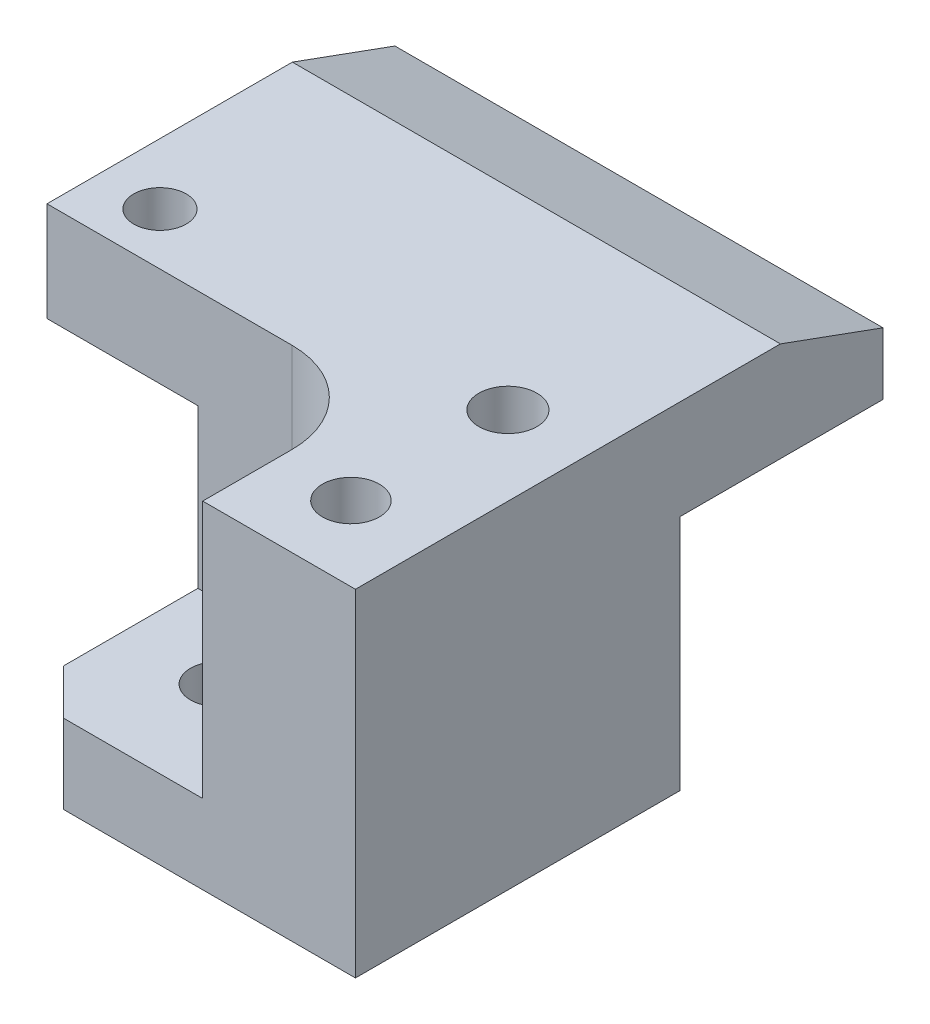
from build123d import *

# Parameters (mm, degrees)
EXTRUDE1_DEPTH                                      = 13.716
EXTRUDE1_DEPTH_BACK                                 = 13.716
SKETCH1_W                                           = 19.558
SKETCH1_H                                           = 14.478
SKETCH16_W                                          = 7.840499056
SKETCH16_H                                          = 8.89
CUT_EXTRUDE1_DEPTH                                  = 37.669366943
SKETCH15_W                                          = 10.471272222
SKETCH15_H                                          = 19.806219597
EXTRUDE2_DEPTH                                      = 4.445
SKETCH19_W                                          = 8.5852
SKETCH19_H                                          = 5.588
EXTRUDE3_DEPTH                                      = 10.095
SKETCH20_W                                          = 8.5852
SKETCH20_H                                          = 21.812500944
EXTRUDE4_DEPTH                                      = 13.335
M3_1_3_1_DIAMETER_HOLE1_D                           = 3.1
SKETCH21_W                                          = 8.480363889
SKETCH21_H                                          = 11.717500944
CUT_EXTRUDE2_DEPTH                                  = 8.89
F_32_0_116_DIAMETER_HOLE1_D                         = 2.9464
SKETCH22_W                                          = 10.366436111
SKETCH22_H                                          = 4.445
EXTRUDE5_DEPTH                                      = 2.006281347
FILLET1_R                                           = 5.08
CBORE_FOR_4_BINDING_HEAD_MACHINE_SCREW1_D           = 3.2639
CBORE_FOR_4_BINDING_HEAD_MACHINE_SCREW1_CBORE_D     = 6.74624
CBORE_FOR_4_BINDING_HEAD_MACHINE_SCREW1_CBORE_DEPTH = 10.16
F_1_8_0_125_DIAMETER_HOLE1_D                        = 3.2004
F_1_8_0_125_DIAMETER_HOLE1_DEPTH                    = 5.08
CHAMFER1_SIZE                                       = 2.54
SKETCH24_W                                          = 18.951636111
SKETCH24_H                                          = 13.335
CUT_EXTRUDE4_DEPTH                                  = 3.556
CUT_EXTRUDE3_DEPTH                                  = 36.735718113
CUT_EXTRUDE3_DEPTH_BACK                             = 36.735718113


with BuildPart() as part:
    # Sketch1 → Extrude1 (new, two sides: drawn at the far end of the back side and taken through both)
    with BuildSketch(Plane(origin=(0, 0, 0), x_dir=(0, 0, -1), z_dir=(1, 0, 0)).offset(-EXTRUDE1_DEPTH_BACK)):
        with Locations((-9.779, 7.239)):
            Rectangle(SKETCH1_W, SKETCH1_H)
    extrude(amount=EXTRUDE1_DEPTH + EXTRUDE1_DEPTH_BACK)

    # Sketch16 → Cut-Extrude1 (cut, through all)
    with BuildSketch(Plane(origin=(13.716, 0, 0), x_dir=(0, 0, -1), z_dir=(1, 0, 0))):
        with Locations((-3.920249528, 4.445)):
            Rectangle(SKETCH16_W, SKETCH16_H)
    extrude(amount=-CUT_EXTRUDE1_DEPTH, mode=Mode.SUBTRACT)

    # Sketch15 → Extrude2 (add)
    with BuildSketch(Plane.XZ):
        with Locations((0, 17.743608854)):
            Rectangle(SKETCH15_W, SKETCH15_H)
    extrude(amount=EXTRUDE2_DEPTH)

    # Sketch19 → Extrude3 (add)
    with BuildSketch(Plane.XY.offset(19.558)):
        with Locations((9.4234, 11.684)):
            Rectangle(SKETCH19_W, SKETCH19_H)
    extrude(amount=EXTRUDE3_DEPTH)

    # Sketch20 → Extrude4 (add)
    with BuildSketch(Plane.XZ.offset(-8.89)):
        with Locations((9.4234, 18.746749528)):
            Rectangle(SKETCH20_W, SKETCH20_H)
    extrude(amount=EXTRUDE4_DEPTH)

    # M3.1 _3.1_ Diameter Hole1 (through all)
    with Locations(Plane(origin=(-3.810605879, 0, 4.162937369), x_dir=(1, 0, 0), z_dir=(0, 1, 0))):
        with Locations((3.806405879, -19.490062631)):
            Hole(M3_1_3_1_DIAMETER_HOLE1_D / 2)

    # Sketch21 → Cut-Extrude2 (cut)
    with BuildSketch(Plane.XZ):
        with Locations((-9.475818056, 13.699249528)):
            Rectangle(SKETCH21_W, SKETCH21_H)
    extrude(amount=-CUT_EXTRUDE2_DEPTH, mode=Mode.SUBTRACT)

    # 32 _0.116_ Diameter Hole1 (through all)
    with Locations(Plane(origin=(0.01320414, 8.89, -8.62598442), x_dir=(1, 0, 0), z_dir=(0, -1, 0))):
        with Locations((-10.30020414, 25.26298442)):
            Hole(F_32_0_116_DIAMETER_HOLE1_D / 2)

    # Sketch22 → Extrude5 (add)
    with BuildSketch(Plane.XY.offset(27.646718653)):
        with Locations((-0.052418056, -2.2225)):
            Rectangle(SKETCH22_W, SKETCH22_H)
    extrude(amount=EXTRUDE5_DEPTH)

    # Fillet1
    fillet1_edges = [part.edges().sort_by_distance(p)[0] for p in [
        (5.1308, 7.239, 19.558),
    ]]
    fillet(fillet1_edges, radius=FILLET1_R)

    # CBORE for _4 Binding Head Machine Screw1 (through all)
    with Locations(Plane.XZ.offset(4.445)):
        with Locations((9.271, 16.637)):
            CounterBoreHole(CBORE_FOR_4_BINDING_HEAD_MACHINE_SCREW1_D / 2, CBORE_FOR_4_BINDING_HEAD_MACHINE_SCREW1_CBORE_D / 2, CBORE_FOR_4_BINDING_HEAD_MACHINE_SCREW1_CBORE_DEPTH)

    # 1_8 _0.125_ Diameter Hole1
    with Locations(Plane(origin=(0, 14.478, 0), x_dir=(-1, 0, 0), z_dir=(0, 1, 0))):
        with Locations((-9.271, 25.462)):
            Hole(F_1_8_0_125_DIAMETER_HOLE1_D / 2, depth=F_1_8_0_125_DIAMETER_HOLE1_DEPTH)

    # Chamfer1
    chamfer1_edges = [part.edges().sort_by_distance(p)[0] for p in [
        (-5.235636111, -2.2225, 29.653),
    ]]
    chamfer(chamfer1_edges, length=CHAMFER1_SIZE)

    # Sketch24 → Cut-Extrude4 (cut)
    with BuildSketch(Plane(origin=(0, 0, 7.840499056), x_dir=(-1, 0, 0), z_dir=(0, 0, -1))):
        with Locations((-4.240181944, 2.2225)):
            Rectangle(SKETCH24_W, SKETCH24_H)
    extrude(amount=-CUT_EXTRUDE4_DEPTH, mode=Mode.SUBTRACT)

    # Sketch23 → Cut-Extrude3 (cut, two sides: drawn at the far end of the back side and taken through both)
    with BuildSketch(Plane(origin=(0, 0, 0), x_dir=(0, 0, -1), z_dir=(1, 0, 0)).offset(-CUT_EXTRUDE3_DEPTH_BACK)):
        Polygon((0, 14.478), (-5.7658, 14.478), (0, 12.379420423), align=None)
    extrude(amount=CUT_EXTRUDE3_DEPTH + CUT_EXTRUDE3_DEPTH_BACK, mode=Mode.SUBTRACT)


solid = part.part
